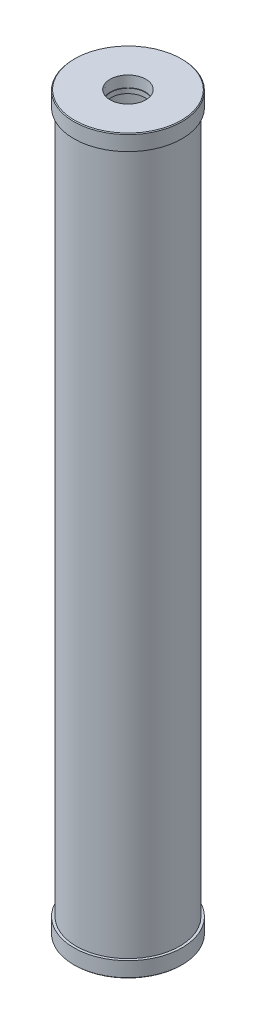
from build123d import *

# Parameters (mm, degrees)
SKETCH1_R           = 84.201
SKETCH1_R_2         = 74.676
BOSS_EXTRUDE1_DEPTH = 1193.8
SKETCH2_R           = 88.265
BOSS_EXTRUDE2_DEPTH = 25.4
BOSS_EXTRUDE3_START = -25.4
SKETCH3_R           = 88.265
BOSS_EXTRUDE3_DEPTH = 25.4
CHAMFER1_SIZE       = 1.27


with BuildPart() as part:
    # Sketch1 → Boss-Extrude1 (new body)
    with BuildSketch(Plane(origin=(0, 0, 0), x_dir=(1, 0, 0), z_dir=(0, 1, 0))):
        with Locations(Location((0, 0, 0), (0, 0, 270))):
            Circle(SKETCH1_R)
        with Locations(Location((0, 0, 0), (0, 0, 270))):
            Circle(SKETCH1_R_2, mode=Mode.SUBTRACT)
    extrude(amount=BOSS_EXTRUDE1_DEPTH)

    # Sketch2 → Boss-Extrude2 (add)
    with BuildSketch(Plane(origin=(0, 0, 0), x_dir=(1, 0, 0), z_dir=(0, 1, 0))):
        with Locations(Location((0, 0, 0), (0, 0, 270))):
            Circle(SKETCH2_R)
    extrude(amount=BOSS_EXTRUDE2_DEPTH)

    # Sketch3 → Boss-Extrude3 (add)
    with BuildSketch(Plane(origin=(0, 1193.8, 0), x_dir=(1, 0, 0), z_dir=(0, 1, 0)).offset(BOSS_EXTRUDE3_START)):
        with Locations(Location((0, 0, 0), (0, 0, 270))):
            Circle(SKETCH3_R)
    extrude(amount=BOSS_EXTRUDE3_DEPTH)

    # Sketch4 → 2 NPT Tapped Hole1 (revolve, cut)
    with BuildSketch(Plane(origin=(0, 1193.8, 0), x_dir=(0, 0, 1), z_dir=(1, 0, 0))):
        Polygon((0, 0), (0, 45.652474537), (27.7876, 28.956), (27.7876, 17.78), (28.63263419, 17.78), (29.1649912, 0), align=None)
    revolve(axis=Axis((0, 1200.15, 0), (0, -1, 0)), mode=Mode.SUBTRACT)

    # Sketch10 → 2 NPT Tapped Hole3 (revolve, cut)
    with BuildSketch(Plane(origin=(0, 0, 0), x_dir=(0, 0, -1), z_dir=(1, 0, 0))):
        Polygon((0, 0), (0, 45.652474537), (27.7876, 28.956), (27.7876, 17.78), (28.63263419, 17.78), (29.1649912, 0), align=None)
    revolve(axis=Axis((0, -6.35, 0), (0, 1, 0)), mode=Mode.SUBTRACT)

    # Chamfer1
    chamfer1_edges = [part.edges().sort_by_distance(p)[0] for p in [
        (0, 0, -88.265),
        (0, 1193.8, -88.265),
    ]]
    chamfer(chamfer1_edges, length=CHAMFER1_SIZE)


solid = part.part
